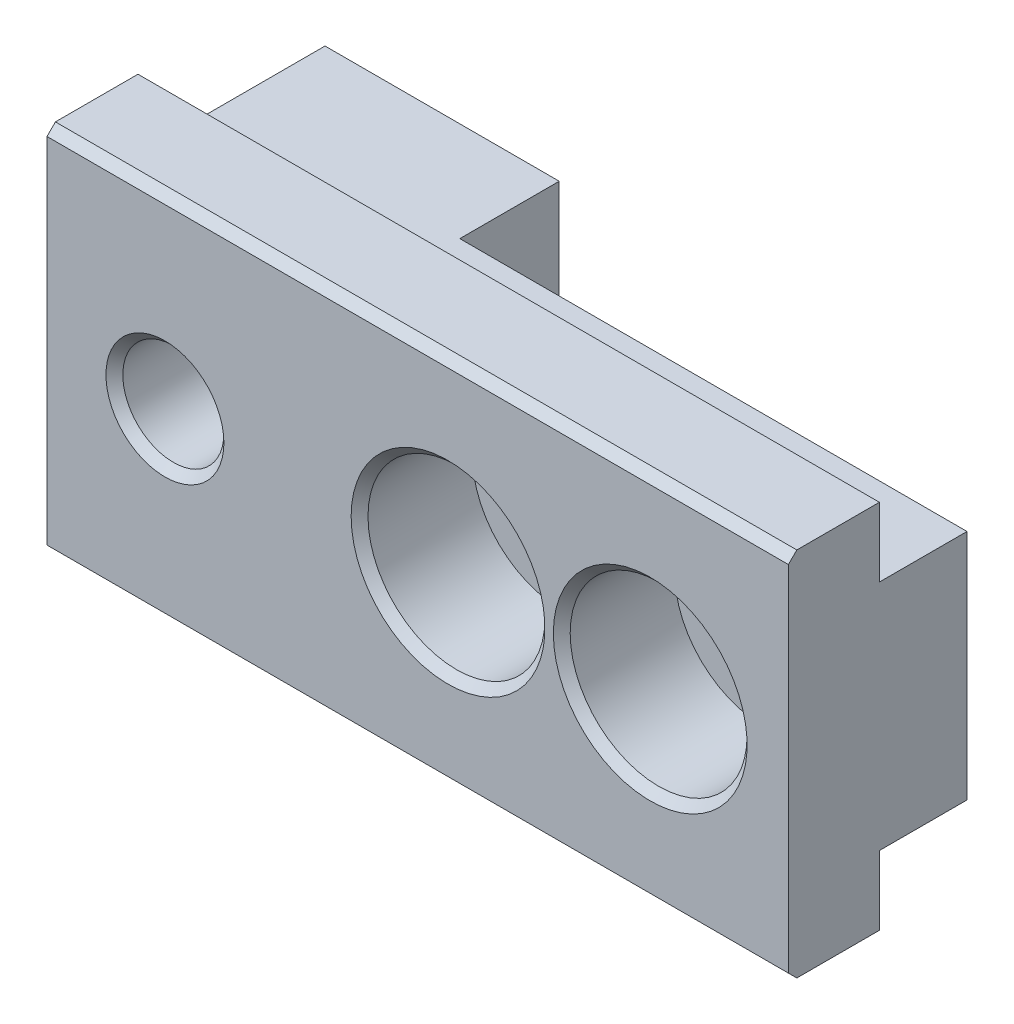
ISO-10303-21;
HEADER;
FILE_DESCRIPTION(('STEP AP214'),'2;1');
FILE_NAME('part.step','',(''),(''),'','','');
FILE_SCHEMA(('AUTOMOTIVE_DESIGN { 1 0 10303 214 1 1 1 1 }'));
ENDSEC;
DATA;
#1=APPLICATION_CONTEXT('core data for automotive mechanical design processes');
#2=APPLICATION_PROTOCOL_DEFINITION('international standard','automotive_design',2000,#1);
#3=PRODUCT_CONTEXT('',#1,'mechanical');
#4=PRODUCT('Part','Part','',(#3));
#5=PRODUCT_RELATED_PRODUCT_CATEGORY('part','',(#4));
#6=PRODUCT_DEFINITION_FORMATION('','',#4);
#7=PRODUCT_DEFINITION_CONTEXT('part definition',#1,'design');
#8=PRODUCT_DEFINITION('design','',#6,#7);
#9=PRODUCT_DEFINITION_SHAPE('','',#8);
#10=(LENGTH_UNIT() NAMED_UNIT(*) SI_UNIT(.MILLI.,.METRE.));
#11=(NAMED_UNIT(*) PLANE_ANGLE_UNIT() SI_UNIT($,.RADIAN.));
#12=(NAMED_UNIT(*) SI_UNIT($,.STERADIAN.) SOLID_ANGLE_UNIT());
#13=UNCERTAINTY_MEASURE_WITH_UNIT(LENGTH_MEASURE(1.E-05),#10,'distance_accuracy_value','');
#14=(GEOMETRIC_REPRESENTATION_CONTEXT(3) GLOBAL_UNCERTAINTY_ASSIGNED_CONTEXT((#13)) GLOBAL_UNIT_ASSIGNED_CONTEXT((#10,
#11,#12)) REPRESENTATION_CONTEXT('',''));
#15=CARTESIAN_POINT('',(0.,0.,0.));
#16=DIRECTION('',(0.,0.,1.));
#17=DIRECTION('',(1.,0.,0.));
#18=AXIS2_PLACEMENT_3D('',#15,#16,#17);
#19=CARTESIAN_POINT('',(28.8,0.,5.4000000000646));
#20=DIRECTION('',(0.,0.,-1.));
#21=DIRECTION('',(0.,1.,0.));
#22=AXIS2_PLACEMENT_3D('',#19,#20,#21);
#23=CYLINDRICAL_SURFACE('',#22,3.1);
#24=CARTESIAN_POINT('',(28.8,0.,-4.7));
#25=DIRECTION('',(0.,0.,1.));
#26=DIRECTION('',(0.,-1.,0.));
#27=AXIS2_PLACEMENT_3D('',#24,#25,#26);
#28=CIRCLE('',#27,3.1);
#29=CARTESIAN_POINT('',(28.8,-3.1,-4.70000000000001));
#30=VERTEX_POINT('',#29);
#31=EDGE_CURVE('E215',#30,#30,#28,.F.);
#32=ORIENTED_EDGE('',*,*,#31,.T.);
#33=EDGE_LOOP('',(#32));
#34=FACE_BOUND('',#33,.T.);
#35=CARTESIAN_POINT('',(28.8,0.,-1.3));
#36=DIRECTION('',(0.,0.,1.));
#37=DIRECTION('',(1.,0.,0.));
#38=AXIS2_PLACEMENT_3D('',#35,#36,#37);
#39=CIRCLE('',#38,3.1);
#40=CARTESIAN_POINT('',(31.9,0.,-1.3));
#41=VERTEX_POINT('',#40);
#42=EDGE_CURVE('E18',#41,#41,#39,.F.);
#43=ORIENTED_EDGE('',*,*,#42,.F.);
#44=EDGE_LOOP('',(#43));
#45=FACE_BOUND('',#44,.T.);
#46=ADVANCED_FACE('F14',(#34,#45),#23,.F.);
#47=CARTESIAN_POINT('',(16.8,0.,5.4000000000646));
#48=DIRECTION('',(0.,0.,-1.));
#49=DIRECTION('',(0.,1.,0.));
#50=AXIS2_PLACEMENT_3D('',#47,#48,#49);
#51=CYLINDRICAL_SURFACE('',#50,3.1);
#52=CARTESIAN_POINT('',(16.8,0.,-4.7));
#53=DIRECTION('',(0.,0.,1.));
#54=DIRECTION('',(0.,-1.,0.));
#55=AXIS2_PLACEMENT_3D('',#52,#53,#54);
#56=CIRCLE('',#55,3.1);
#57=CARTESIAN_POINT('',(16.8,-3.1,-4.70000000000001));
#58=VERTEX_POINT('',#57);
#59=EDGE_CURVE('E224',#58,#58,#56,.F.);
#60=ORIENTED_EDGE('',*,*,#59,.T.);
#61=EDGE_LOOP('',(#60));
#62=FACE_BOUND('',#61,.T.);
#63=CARTESIAN_POINT('',(16.8,0.,-1.3));
#64=DIRECTION('',(0.,0.,1.));
#65=DIRECTION('',(1.,0.,0.));
#66=AXIS2_PLACEMENT_3D('',#63,#64,#65);
#67=CIRCLE('',#66,3.1);
#68=CARTESIAN_POINT('',(19.9,0.,-1.3));
#69=VERTEX_POINT('',#68);
#70=EDGE_CURVE('E234',#69,#69,#67,.F.);
#71=ORIENTED_EDGE('',*,*,#70,.F.);
#72=EDGE_LOOP('',(#71));
#73=FACE_BOUND('',#72,.T.);
#74=ADVANCED_FACE('F271',(#62,#73),#51,.F.);
#75=CARTESIAN_POINT('',(0.,0.,-11.0999999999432));
#76=DIRECTION('',(0.,0.,-1.));
#77=DIRECTION('',(-1.,0.,0.));
#78=AXIS2_PLACEMENT_3D('',#75,#76,#77);
#79=CONICAL_SURFACE('',#78,3.50000000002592,0.785398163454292);
#80=CARTESIAN_POINT('',(0.,0.,-11.0999999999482));
#81=DIRECTION('',(0.,0.,-1.));
#82=DIRECTION('',(-1.,0.,0.));
#83=AXIS2_PLACEMENT_3D('',#80,#81,#82);
#84=CIRCLE('',#83,3.50000000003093);
#85=CARTESIAN_POINT('',(-3.50000000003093,0.,-11.0999999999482));
#86=VERTEX_POINT('',#85);
#87=EDGE_CURVE('E189',#86,#86,#84,.T.);
#88=ORIENTED_EDGE('',*,*,#87,.T.);
#89=EDGE_LOOP('',(#88));
#90=FACE_BOUND('',#89,.T.);
#91=CARTESIAN_POINT('',(0.,0.,-10.6));
#92=DIRECTION('',(0.,0.,1.));
#93=DIRECTION('',(1.,0.,0.));
#94=AXIS2_PLACEMENT_3D('',#91,#92,#93);
#95=CIRCLE('',#94,3.);
#96=CARTESIAN_POINT('',(3.,0.,-10.6));
#97=VERTEX_POINT('',#96);
#98=EDGE_CURVE('E145',#97,#97,#95,.T.);
#99=ORIENTED_EDGE('',*,*,#98,.T.);
#100=EDGE_LOOP('',(#99));
#101=FACE_BOUND('',#100,.T.);
#102=ADVANCED_FACE('F278',(#90,#101),#79,.F.);
#103=CARTESIAN_POINT('',(0.,0.,0.4));
#104=DIRECTION('',(0.,0.,1.));
#105=DIRECTION('',(1.,0.,0.));
#106=AXIS2_PLACEMENT_3D('',#103,#104,#105);
#107=CYLINDRICAL_SURFACE('',#106,3.);
#108=CARTESIAN_POINT('',(0.,0.,4.9000000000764));
#109=DIRECTION('',(0.,0.,1.));
#110=DIRECTION('',(1.,0.,0.));
#111=AXIS2_PLACEMENT_3D('',#108,#109,#110);
#112=CIRCLE('',#111,2.99999999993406);
#113=CARTESIAN_POINT('',(2.99999999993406,0.,4.9000000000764));
#114=VERTEX_POINT('',#113);
#115=EDGE_CURVE('E179',#114,#114,#112,.T.);
#116=ORIENTED_EDGE('',*,*,#115,.T.);
#117=EDGE_LOOP('',(#116));
#118=FACE_BOUND('',#117,.T.);
#119=ORIENTED_EDGE('',*,*,#98,.F.);
#120=EDGE_LOOP('',(#119));
#121=FACE_BOUND('',#120,.T.);
#122=ADVANCED_FACE('F330',(#118,#121),#107,.F.);
#123=CARTESIAN_POINT('',(7.,-6.9,-11.1));
#124=DIRECTION('',(0.,0.,1.));
#125=DIRECTION('',(1.,0.,0.));
#126=AXIS2_PLACEMENT_3D('',#123,#124,#125);
#127=PLANE('',#126);
#128=DIRECTION('',(1.,0.,0.));
#129=VECTOR('',#128,1.);
#130=CARTESIAN_POINT('',(7.,6.9,-11.1));
#131=LINE('',#130,#129);
#132=CARTESIAN_POINT('',(-7.,6.9,-11.1));
#133=VERTEX_POINT('',#132);
#134=CARTESIAN_POINT('',(6.9,6.9,-11.1));
#135=VERTEX_POINT('',#134);
#136=EDGE_CURVE('E117',#133,#135,#131,.T.);
#137=ORIENTED_EDGE('',*,*,#136,.T.);
#138=DIRECTION('',(0.,1.,0.));
#139=VECTOR('',#138,1.);
#140=CARTESIAN_POINT('',(6.9,-15.5837353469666,-11.1));
#141=LINE('',#140,#139);
#142=CARTESIAN_POINT('',(6.9,-6.9,-11.1));
#143=VERTEX_POINT('',#142);
#144=EDGE_CURVE('E31',#143,#135,#141,.T.);
#145=ORIENTED_EDGE('',*,*,#144,.F.);
#146=DIRECTION('',(-1.,0.,0.));
#147=VECTOR('',#146,1.);
#148=CARTESIAN_POINT('',(7.,-6.9,-11.1));
#149=LINE('',#148,#147);
#150=CARTESIAN_POINT('',(-7.,-6.9,-11.1));
#151=VERTEX_POINT('',#150);
#152=EDGE_CURVE('E118',#143,#151,#149,.T.);
#153=ORIENTED_EDGE('',*,*,#152,.T.);
#154=DIRECTION('',(0.,-1.,0.));
#155=VECTOR('',#154,1.);
#156=CARTESIAN_POINT('',(-7.,-6.9,-11.1));
#157=LINE('',#156,#155);
#158=EDGE_CURVE('E171',#133,#151,#157,.T.);
#159=ORIENTED_EDGE('',*,*,#158,.F.);
#160=EDGE_LOOP('',(#137,#145,#153,#159));
#161=FACE_BOUND('',#160,.T.);
#162=ORIENTED_EDGE('',*,*,#87,.F.);
#163=EDGE_LOOP('',(#162));
#164=FACE_BOUND('',#163,.T.);
#165=ADVANCED_FACE('F326',(#161,#164),#127,.F.);
#166=CARTESIAN_POINT('',(7.,-12.3,0.));
#167=DIRECTION('',(0.,0.,1.));
#168=DIRECTION('',(1.,0.,0.));
#169=AXIS2_PLACEMENT_3D('',#166,#167,#168);
#170=PLANE('',#169);
#171=DIRECTION('',(0.,1.,0.));
#172=VECTOR('',#171,1.);
#173=CARTESIAN_POINT('',(37.,-6.9,0.));
#174=LINE('',#173,#172);
#175=CARTESIAN_POINT('',(37.,-11.,0.));
#176=VERTEX_POINT('',#175);
#177=CARTESIAN_POINT('',(37.,-6.9,0.));
#178=VERTEX_POINT('',#177);
#179=EDGE_CURVE('E162',#176,#178,#174,.T.);
#180=ORIENTED_EDGE('',*,*,#179,.F.);
#181=DIRECTION('',(-1.,0.,0.));
#182=VECTOR('',#181,1.);
#183=CARTESIAN_POINT('',(7.,-11.,0.));
#184=LINE('',#183,#182);
#185=CARTESIAN_POINT('',(-7.,-11.,0.));
#186=VERTEX_POINT('',#185);
#187=EDGE_CURVE('E141',#176,#186,#184,.T.);
#188=ORIENTED_EDGE('',*,*,#187,.T.);
#189=DIRECTION('',(0.,-1.,0.));
#190=VECTOR('',#189,1.);
#191=CARTESIAN_POINT('',(-7.,-6.9,0.));
#192=LINE('',#191,#190);
#193=CARTESIAN_POINT('',(-7.,-6.9,0.));
#194=VERTEX_POINT('',#193);
#195=EDGE_CURVE('E165',#194,#186,#192,.T.);
#196=ORIENTED_EDGE('',*,*,#195,.F.);
#197=DIRECTION('',(-1.,0.,0.));
#198=VECTOR('',#197,1.);
#199=CARTESIAN_POINT('',(7.,-6.9,0.));
#200=LINE('',#199,#198);
#201=EDGE_CURVE('E187',#194,#178,#200,.F.);
#202=ORIENTED_EDGE('',*,*,#201,.T.);
#203=EDGE_LOOP('',(#180,#188,#196,#202));
#204=FACE_BOUND('',#203,.T.);
#205=ADVANCED_FACE('F323',(#204),#170,.F.);
#206=CARTESIAN_POINT('',(7.,-6.9,-11.1));
#207=DIRECTION('',(0.,1.,0.));
#208=DIRECTION('',(-1.,0.,0.));
#209=AXIS2_PLACEMENT_3D('',#206,#207,#208);
#210=PLANE('',#209);
#211=DIRECTION('',(0.,0.,1.));
#212=VECTOR('',#211,1.);
#213=CARTESIAN_POINT('',(6.9,-6.9,-11.1));
#214=LINE('',#213,#212);
#215=CARTESIAN_POINT('',(6.9,-6.9,-5.2));
#216=VERTEX_POINT('',#215);
#217=EDGE_CURVE('E121',#143,#216,#214,.T.);
#218=ORIENTED_EDGE('',*,*,#217,.T.);
#219=DIRECTION('',(1.,0.,0.));
#220=VECTOR('',#219,1.);
#221=CARTESIAN_POINT('',(37.,-6.9,-5.2));
#222=LINE('',#221,#220);
#223=CARTESIAN_POINT('',(37.,-6.9,-5.2));
#224=VERTEX_POINT('',#223);
#225=EDGE_CURVE('E107',#216,#224,#222,.T.);
#226=ORIENTED_EDGE('',*,*,#225,.T.);
#227=DIRECTION('',(0.,0.,1.));
#228=VECTOR('',#227,1.);
#229=CARTESIAN_POINT('',(37.,-6.9,-11.1));
#230=LINE('',#229,#228);
#231=EDGE_CURVE('E160',#178,#224,#230,.F.);
#232=ORIENTED_EDGE('',*,*,#231,.F.);
#233=ORIENTED_EDGE('',*,*,#201,.F.);
#234=DIRECTION('',(0.,0.,1.));
#235=VECTOR('',#234,1.);
#236=CARTESIAN_POINT('',(-7.,-6.9,-11.1));
#237=LINE('',#236,#235);
#238=EDGE_CURVE('E168',#151,#194,#237,.T.);
#239=ORIENTED_EDGE('',*,*,#238,.F.);
#240=ORIENTED_EDGE('',*,*,#152,.F.);
#241=EDGE_LOOP('',(#218,#226,#232,#233,#239,#240));
#242=FACE_BOUND('',#241,.T.);
#243=ADVANCED_FACE('F125',(#242),#210,.F.);
#244=CARTESIAN_POINT('',(37.,6.9,-5.2));
#245=DIRECTION('',(0.,0.,1.));
#246=DIRECTION('',(0.,-1.,0.));
#247=AXIS2_PLACEMENT_3D('',#244,#245,#246);
#248=PLANE('',#247);
#249=CARTESIAN_POINT('',(28.8,0.,-5.2));
#250=DIRECTION('',(0.,0.,1.));
#251=DIRECTION('',(0.,-1.,0.));
#252=AXIS2_PLACEMENT_3D('',#249,#250,#251);
#253=CIRCLE('',#252,3.6);
#254=CARTESIAN_POINT('',(28.8,-3.6,-5.2));
#255=VERTEX_POINT('',#254);
#256=EDGE_CURVE('E221',#255,#255,#253,.T.);
#257=ORIENTED_EDGE('',*,*,#256,.T.);
#258=EDGE_LOOP('',(#257));
#259=FACE_BOUND('',#258,.T.);
#260=CARTESIAN_POINT('',(16.8,0.,-5.2));
#261=DIRECTION('',(0.,0.,1.));
#262=DIRECTION('',(0.,-1.,0.));
#263=AXIS2_PLACEMENT_3D('',#260,#261,#262);
#264=CIRCLE('',#263,3.6);
#265=CARTESIAN_POINT('',(16.8,-3.6,-5.2));
#266=VERTEX_POINT('',#265);
#267=EDGE_CURVE('E218',#266,#266,#264,.T.);
#268=ORIENTED_EDGE('',*,*,#267,.T.);
#269=EDGE_LOOP('',(#268));
#270=FACE_BOUND('',#269,.T.);
#271=DIRECTION('',(0.,1.,0.));
#272=VECTOR('',#271,1.);
#273=CARTESIAN_POINT('',(37.,-6.9,-5.2));
#274=LINE('',#273,#272);
#275=CARTESIAN_POINT('',(37.,6.9,-5.2));
#276=VERTEX_POINT('',#275);
#277=EDGE_CURVE('E112',#224,#276,#274,.T.);
#278=ORIENTED_EDGE('',*,*,#277,.F.);
#279=ORIENTED_EDGE('',*,*,#225,.F.);
#280=DIRECTION('',(0.,1.,0.));
#281=VECTOR('',#280,1.);
#282=CARTESIAN_POINT('',(6.9,-15.5837353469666,-5.2));
#283=LINE('',#282,#281);
#284=CARTESIAN_POINT('',(6.9,6.9,-5.2));
#285=VERTEX_POINT('',#284);
#286=EDGE_CURVE('E110',#216,#285,#283,.T.);
#287=ORIENTED_EDGE('',*,*,#286,.T.);
#288=DIRECTION('',(1.,0.,0.));
#289=VECTOR('',#288,1.);
#290=CARTESIAN_POINT('',(7.,6.9,-5.2));
#291=LINE('',#290,#289);
#292=EDGE_CURVE('E182',#285,#276,#291,.T.);
#293=ORIENTED_EDGE('',*,*,#292,.T.);
#294=EDGE_LOOP('',(#278,#279,#287,#293));
#295=FACE_BOUND('',#294,.T.);
#296=ADVANCED_FACE('F109',(#259,#270,#295),#248,.F.);
#297=CARTESIAN_POINT('',(7.,6.9,-11.1));
#298=DIRECTION('',(0.,-1.,0.));
#299=DIRECTION('',(1.,0.,0.));
#300=AXIS2_PLACEMENT_3D('',#297,#298,#299);
#301=PLANE('',#300);
#302=DIRECTION('',(1.,0.,0.));
#303=VECTOR('',#302,1.);
#304=CARTESIAN_POINT('',(7.,6.9,0.));
#305=LINE('',#304,#303);
#306=CARTESIAN_POINT('',(-7.,6.9,0.));
#307=VERTEX_POINT('',#306);
#308=CARTESIAN_POINT('',(37.,6.9,0.));
#309=VERTEX_POINT('',#308);
#310=EDGE_CURVE('E180',#307,#309,#305,.T.);
#311=ORIENTED_EDGE('',*,*,#310,.T.);
#312=DIRECTION('',(0.,0.,1.));
#313=VECTOR('',#312,1.);
#314=CARTESIAN_POINT('',(37.,6.9,-11.1));
#315=LINE('',#314,#313);
#316=EDGE_CURVE('E156',#276,#309,#315,.T.);
#317=ORIENTED_EDGE('',*,*,#316,.F.);
#318=ORIENTED_EDGE('',*,*,#292,.F.);
#319=DIRECTION('',(0.,0.,-1.));
#320=VECTOR('',#319,1.);
#321=CARTESIAN_POINT('',(6.9,6.9,-11.1));
#322=LINE('',#321,#320);
#323=EDGE_CURVE('E122',#285,#135,#322,.T.);
#324=ORIENTED_EDGE('',*,*,#323,.T.);
#325=ORIENTED_EDGE('',*,*,#136,.F.);
#326=DIRECTION('',(0.,0.,1.));
#327=VECTOR('',#326,1.);
#328=CARTESIAN_POINT('',(-7.,6.9,-11.1));
#329=LINE('',#328,#327);
#330=EDGE_CURVE('E174',#307,#133,#329,.F.);
#331=ORIENTED_EDGE('',*,*,#330,.F.);
#332=EDGE_LOOP('',(#311,#317,#318,#324,#325,#331));
#333=FACE_BOUND('',#332,.T.);
#334=ADVANCED_FACE('F313',(#333),#301,.F.);
#335=CARTESIAN_POINT('',(7.,6.9,0.));
#336=DIRECTION('',(0.,0.,1.));
#337=DIRECTION('',(1.,0.,0.));
#338=AXIS2_PLACEMENT_3D('',#335,#336,#337);
#339=PLANE('',#338);
#340=DIRECTION('',(0.,-1.,0.));
#341=VECTOR('',#340,1.);
#342=CARTESIAN_POINT('',(-7.,-6.9,0.));
#343=LINE('',#342,#341);
#344=CARTESIAN_POINT('',(-7.,11.,0.));
#345=VERTEX_POINT('',#344);
#346=EDGE_CURVE('E177',#345,#307,#343,.T.);
#347=ORIENTED_EDGE('',*,*,#346,.F.);
#348=DIRECTION('',(1.,0.,0.));
#349=VECTOR('',#348,1.);
#350=CARTESIAN_POINT('',(7.,11.,0.));
#351=LINE('',#350,#349);
#352=CARTESIAN_POINT('',(37.,11.,0.));
#353=VERTEX_POINT('',#352);
#354=EDGE_CURVE('E133',#345,#353,#351,.T.);
#355=ORIENTED_EDGE('',*,*,#354,.T.);
#356=DIRECTION('',(0.,1.,0.));
#357=VECTOR('',#356,1.);
#358=CARTESIAN_POINT('',(37.,-6.9,0.));
#359=LINE('',#358,#357);
#360=EDGE_CURVE('E153',#309,#353,#359,.T.);
#361=ORIENTED_EDGE('',*,*,#360,.F.);
#362=ORIENTED_EDGE('',*,*,#310,.F.);
#363=EDGE_LOOP('',(#347,#355,#361,#362));
#364=FACE_BOUND('',#363,.T.);
#365=ADVANCED_FACE('F309',(#364),#339,.F.);
#366=CARTESIAN_POINT('',(0.,0.,5.40000000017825));
#367=DIRECTION('',(0.,0.,1.));
#368=DIRECTION('',(1.,0.,0.));
#369=AXIS2_PLACEMENT_3D('',#366,#367,#368);
#370=CONICAL_SURFACE('',#369,3.50000000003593,0.785398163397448);
#371=CARTESIAN_POINT('',(0.,0.,5.4000000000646));
#372=DIRECTION('',(0.,0.,1.));
#373=DIRECTION('',(1.,0.,0.));
#374=AXIS2_PLACEMENT_3D('',#371,#372,#373);
#375=CIRCLE('',#374,3.49999999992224);
#376=CARTESIAN_POINT('',(3.49999999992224,0.,5.4000000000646));
#377=VERTEX_POINT('',#376);
#378=EDGE_CURVE('E152',#377,#377,#375,.T.);
#379=ORIENTED_EDGE('',*,*,#378,.T.);
#380=EDGE_LOOP('',(#379));
#381=FACE_BOUND('',#380,.T.);
#382=ORIENTED_EDGE('',*,*,#115,.F.);
#383=EDGE_LOOP('',(#382));
#384=FACE_BOUND('',#383,.T.);
#385=ADVANCED_FACE('F305',(#381,#384),#370,.F.);
#386=CARTESIAN_POINT('',(-7.,-6.9,-11.1));
#387=DIRECTION('',(-1.,0.,0.));
#388=DIRECTION('',(0.,-1.,0.));
#389=AXIS2_PLACEMENT_3D('',#386,#387,#388);
#390=PLANE('',#389);
#391=DIRECTION('',(0.,1.,0.));
#392=VECTOR('',#391,1.);
#393=CARTESIAN_POINT('',(-7.,-12.3,5.4));
#394=LINE('',#393,#392);
#395=CARTESIAN_POINT('',(-7.,-10.5,5.4));
#396=VERTEX_POINT('',#395);
#397=CARTESIAN_POINT('',(-7.,10.5,5.4));
#398=VERTEX_POINT('',#397);
#399=EDGE_CURVE('E149',#396,#398,#394,.T.);
#400=ORIENTED_EDGE('',*,*,#399,.T.);
#401=DIRECTION('',(0.,-0.707106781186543,0.707106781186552));
#402=VECTOR('',#401,1.);
#403=CARTESIAN_POINT('',(-7.,10.0500000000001,5.84999999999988));
#404=LINE('',#403,#402);
#405=CARTESIAN_POINT('',(-7.,11.,4.9));
#406=VERTEX_POINT('',#405);
#407=EDGE_CURVE('E205',#398,#406,#404,.F.);
#408=ORIENTED_EDGE('',*,*,#407,.T.);
#409=DIRECTION('',(0.,0.,-1.));
#410=VECTOR('',#409,1.);
#411=CARTESIAN_POINT('',(-7.,11.,8.14875405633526));
#412=LINE('',#411,#410);
#413=EDGE_CURVE('E129',#406,#345,#412,.T.);
#414=ORIENTED_EDGE('',*,*,#413,.T.);
#415=ORIENTED_EDGE('',*,*,#346,.T.);
#416=ORIENTED_EDGE('',*,*,#330,.T.);
#417=ORIENTED_EDGE('',*,*,#158,.T.);
#418=ORIENTED_EDGE('',*,*,#238,.T.);
#419=ORIENTED_EDGE('',*,*,#195,.T.);
#420=DIRECTION('',(0.,0.,1.));
#421=VECTOR('',#420,1.);
#422=CARTESIAN_POINT('',(-7.,-11.,8.14875405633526));
#423=LINE('',#422,#421);
#424=CARTESIAN_POINT('',(-7.,-11.,4.9));
#425=VERTEX_POINT('',#424);
#426=EDGE_CURVE('E138',#186,#425,#423,.T.);
#427=ORIENTED_EDGE('',*,*,#426,.T.);
#428=DIRECTION('',(0.,-0.707106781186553,-0.707106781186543));
#429=VECTOR('',#428,1.);
#430=CARTESIAN_POINT('',(-7.,-16.95,-1.04999999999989));
#431=LINE('',#430,#429);
#432=EDGE_CURVE('E203',#425,#396,#431,.F.);
#433=ORIENTED_EDGE('',*,*,#432,.T.);
#434=EDGE_LOOP('',(#400,#408,#414,#415,#416,#417,#418,#419,#427,#433));
#435=FACE_BOUND('',#434,.T.);
#436=ADVANCED_FACE('F302',(#435),#390,.T.);
#437=CARTESIAN_POINT('',(37.,-6.9,-11.1));
#438=DIRECTION('',(1.,0.,0.));
#439=DIRECTION('',(0.,1.,0.));
#440=AXIS2_PLACEMENT_3D('',#437,#438,#439);
#441=PLANE('',#440);
#442=ORIENTED_EDGE('',*,*,#179,.T.);
#443=ORIENTED_EDGE('',*,*,#231,.T.);
#444=ORIENTED_EDGE('',*,*,#277,.T.);
#445=ORIENTED_EDGE('',*,*,#316,.T.);
#446=ORIENTED_EDGE('',*,*,#360,.T.);
#447=DIRECTION('',(0.,0.,-1.));
#448=VECTOR('',#447,1.);
#449=CARTESIAN_POINT('',(37.,11.,8.14875405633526));
#450=LINE('',#449,#448);
#451=CARTESIAN_POINT('',(37.,11.,4.9));
#452=VERTEX_POINT('',#451);
#453=EDGE_CURVE('E127',#452,#353,#450,.T.);
#454=ORIENTED_EDGE('',*,*,#453,.F.);
#455=DIRECTION('',(0.,0.707106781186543,-0.707106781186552));
#456=VECTOR('',#455,1.);
#457=CARTESIAN_POINT('',(37.,10.0500000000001,5.84999999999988));
#458=LINE('',#457,#456);
#459=CARTESIAN_POINT('',(37.,10.5,5.4));
#460=VERTEX_POINT('',#459);
#461=EDGE_CURVE('E210',#452,#460,#458,.F.);
#462=ORIENTED_EDGE('',*,*,#461,.T.);
#463=DIRECTION('',(0.,1.,0.));
#464=VECTOR('',#463,1.);
#465=CARTESIAN_POINT('',(37.,-12.3,5.4));
#466=LINE('',#465,#464);
#467=CARTESIAN_POINT('',(37.,-10.5,5.4));
#468=VERTEX_POINT('',#467);
#469=EDGE_CURVE('E146',#460,#468,#466,.F.);
#470=ORIENTED_EDGE('',*,*,#469,.T.);
#471=DIRECTION('',(0.,0.707106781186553,0.707106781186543));
#472=VECTOR('',#471,1.);
#473=CARTESIAN_POINT('',(37.,-16.95,-1.04999999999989));
#474=LINE('',#473,#472);
#475=CARTESIAN_POINT('',(37.,-11.,4.9));
#476=VERTEX_POINT('',#475);
#477=EDGE_CURVE('E39',#468,#476,#474,.F.);
#478=ORIENTED_EDGE('',*,*,#477,.T.);
#479=DIRECTION('',(0.,0.,1.));
#480=VECTOR('',#479,1.);
#481=CARTESIAN_POINT('',(37.,-11.,8.14875405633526));
#482=LINE('',#481,#480);
#483=EDGE_CURVE('E137',#176,#476,#482,.T.);
#484=ORIENTED_EDGE('',*,*,#483,.F.);
#485=EDGE_LOOP('',(#442,#443,#444,#445,#446,#454,#462,#470,#478,#484));
#486=FACE_BOUND('',#485,.T.);
#487=ADVANCED_FACE('F298',(#486),#441,.T.);
#488=CARTESIAN_POINT('',(7.,-12.3,5.4));
#489=DIRECTION('',(0.,0.,-1.));
#490=DIRECTION('',(-1.,0.,0.));
#491=AXIS2_PLACEMENT_3D('',#488,#489,#490);
#492=PLANE('',#491);
#493=CARTESIAN_POINT('',(28.8,0.,5.4));
#494=DIRECTION('',(0.,0.,-1.));
#495=DIRECTION('',(-1.,0.,0.));
#496=AXIS2_PLACEMENT_3D('',#493,#494,#495);
#497=CIRCLE('',#496,5.75);
#498=CARTESIAN_POINT('',(23.05,0.,5.4));
#499=VERTEX_POINT('',#498);
#500=EDGE_CURVE('E23',#499,#499,#497,.T.);
#501=ORIENTED_EDGE('',*,*,#500,.T.);
#502=EDGE_LOOP('',(#501));
#503=FACE_BOUND('',#502,.T.);
#504=CARTESIAN_POINT('',(16.8,0.,5.4));
#505=DIRECTION('',(0.,0.,-1.));
#506=DIRECTION('',(-1.,0.,0.));
#507=AXIS2_PLACEMENT_3D('',#504,#505,#506);
#508=CIRCLE('',#507,5.75);
#509=CARTESIAN_POINT('',(11.05,0.,5.4));
#510=VERTEX_POINT('',#509);
#511=EDGE_CURVE('E230',#510,#510,#508,.T.);
#512=ORIENTED_EDGE('',*,*,#511,.T.);
#513=EDGE_LOOP('',(#512));
#514=FACE_BOUND('',#513,.T.);
#515=DIRECTION('',(1.,0.,0.));
#516=VECTOR('',#515,1.);
#517=CARTESIAN_POINT('',(7.,-10.5,5.4));
#518=LINE('',#517,#516);
#519=EDGE_CURVE('E148',#396,#468,#518,.T.);
#520=ORIENTED_EDGE('',*,*,#519,.T.);
#521=ORIENTED_EDGE('',*,*,#469,.F.);
#522=DIRECTION('',(-1.,0.,0.));
#523=VECTOR('',#522,1.);
#524=CARTESIAN_POINT('',(7.,10.5,5.4));
#525=LINE('',#524,#523);
#526=EDGE_CURVE('E200',#460,#398,#525,.T.);
#527=ORIENTED_EDGE('',*,*,#526,.T.);
#528=ORIENTED_EDGE('',*,*,#399,.F.);
#529=EDGE_LOOP('',(#520,#521,#527,#528));
#530=FACE_BOUND('',#529,.T.);
#531=ORIENTED_EDGE('',*,*,#378,.F.);
#532=EDGE_LOOP('',(#531));
#533=FACE_BOUND('',#532,.T.);
#534=ADVANCED_FACE('F281',(#503,#514,#530,#533),#492,.F.);
#535=CARTESIAN_POINT('',(-7.,-11.,8.14875405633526));
#536=DIRECTION('',(0.,1.,0.));
#537=DIRECTION('',(0.,0.,1.));
#538=AXIS2_PLACEMENT_3D('',#535,#536,#537);
#539=PLANE('',#538);
#540=ORIENTED_EDGE('',*,*,#483,.T.);
#541=DIRECTION('',(-1.,0.,0.));
#542=VECTOR('',#541,1.);
#543=CARTESIAN_POINT('',(-7.,-11.,4.9));
#544=LINE('',#543,#542);
#545=EDGE_CURVE('E212',#476,#425,#544,.T.);
#546=ORIENTED_EDGE('',*,*,#545,.T.);
#547=ORIENTED_EDGE('',*,*,#426,.F.);
#548=ORIENTED_EDGE('',*,*,#187,.F.);
#549=EDGE_LOOP('',(#540,#546,#547,#548));
#550=FACE_BOUND('',#549,.T.);
#551=ADVANCED_FACE('F291',(#550),#539,.F.);
#552=CARTESIAN_POINT('',(-7.,11.,8.14875405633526));
#553=DIRECTION('',(0.,-1.,0.));
#554=DIRECTION('',(1.,0.,0.));
#555=AXIS2_PLACEMENT_3D('',#552,#553,#554);
#556=PLANE('',#555);
#557=ORIENTED_EDGE('',*,*,#413,.F.);
#558=DIRECTION('',(1.,0.,0.));
#559=VECTOR('',#558,1.);
#560=CARTESIAN_POINT('',(-7.,11.,4.9));
#561=LINE('',#560,#559);
#562=EDGE_CURVE('E207',#406,#452,#561,.T.);
#563=ORIENTED_EDGE('',*,*,#562,.T.);
#564=ORIENTED_EDGE('',*,*,#453,.T.);
#565=ORIENTED_EDGE('',*,*,#354,.F.);
#566=EDGE_LOOP('',(#557,#563,#564,#565));
#567=FACE_BOUND('',#566,.T.);
#568=ADVANCED_FACE('F287',(#567),#556,.F.);
#569=CARTESIAN_POINT('',(7.,10.5,5.4));
#570=DIRECTION('',(0.,-0.707106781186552,-0.707106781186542));
#571=DIRECTION('',(-1.,0.,0.));
#572=AXIS2_PLACEMENT_3D('',#569,#570,#571);
#573=PLANE('',#572);
#574=ORIENTED_EDGE('',*,*,#461,.F.);
#575=ORIENTED_EDGE('',*,*,#562,.F.);
#576=ORIENTED_EDGE('',*,*,#407,.F.);
#577=ORIENTED_EDGE('',*,*,#526,.F.);
#578=EDGE_LOOP('',(#574,#575,#576,#577));
#579=FACE_BOUND('',#578,.T.);
#580=ADVANCED_FACE('F290',(#579),#573,.F.);
#581=CARTESIAN_POINT('',(7.,-10.5,5.4));
#582=DIRECTION('',(0.,0.707106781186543,-0.707106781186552));
#583=DIRECTION('',(1.,0.,0.));
#584=AXIS2_PLACEMENT_3D('',#581,#582,#583);
#585=PLANE('',#584);
#586=ORIENTED_EDGE('',*,*,#432,.F.);
#587=ORIENTED_EDGE('',*,*,#545,.F.);
#588=ORIENTED_EDGE('',*,*,#477,.F.);
#589=ORIENTED_EDGE('',*,*,#519,.F.);
#590=EDGE_LOOP('',(#586,#587,#588,#589));
#591=FACE_BOUND('',#590,.T.);
#592=ADVANCED_FACE('F286',(#591),#585,.F.);
#593=CARTESIAN_POINT('',(6.9,-15.5837353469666,25.7532769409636));
#594=DIRECTION('',(-1.,0.,0.));
#595=DIRECTION('',(0.,-1.,0.));
#596=AXIS2_PLACEMENT_3D('',#593,#594,#595);
#597=PLANE('',#596);
#598=ORIENTED_EDGE('',*,*,#144,.T.);
#599=ORIENTED_EDGE('',*,*,#323,.F.);
#600=ORIENTED_EDGE('',*,*,#286,.F.);
#601=ORIENTED_EDGE('',*,*,#217,.F.);
#602=EDGE_LOOP('',(#598,#599,#600,#601));
#603=FACE_BOUND('',#602,.T.);
#604=ADVANCED_FACE('F120',(#603),#597,.F.);
#605=CARTESIAN_POINT('',(16.8,0.,0.4));
#606=DIRECTION('',(0.,0.,1.));
#607=DIRECTION('',(1.,0.,0.));
#608=AXIS2_PLACEMENT_3D('',#605,#606,#607);
#609=CYLINDRICAL_SURFACE('',#608,5.25);
#610=CARTESIAN_POINT('',(16.8,0.,4.9));
#611=DIRECTION('',(0.,0.,-1.));
#612=DIRECTION('',(-1.,0.,0.));
#613=AXIS2_PLACEMENT_3D('',#610,#611,#612);
#614=CIRCLE('',#613,5.25);
#615=CARTESIAN_POINT('',(11.55,0.,4.9));
#616=VERTEX_POINT('',#615);
#617=EDGE_CURVE('E9',#616,#616,#614,.F.);
#618=ORIENTED_EDGE('',*,*,#617,.T.);
#619=EDGE_LOOP('',(#618));
#620=FACE_BOUND('',#619,.T.);
#621=CARTESIAN_POINT('',(16.8,0.,-1.3));
#622=DIRECTION('',(0.,0.,1.));
#623=DIRECTION('',(1.,0.,0.));
#624=AXIS2_PLACEMENT_3D('',#621,#622,#623);
#625=CIRCLE('',#624,5.25);
#626=CARTESIAN_POINT('',(22.05,0.,-1.3));
#627=VERTEX_POINT('',#626);
#628=EDGE_CURVE('E236',#627,#627,#625,.T.);
#629=ORIENTED_EDGE('',*,*,#628,.F.);
#630=EDGE_LOOP('',(#629));
#631=FACE_BOUND('',#630,.T.);
#632=ADVANCED_FACE('F255',(#620,#631),#609,.F.);
#633=CARTESIAN_POINT('',(28.8,0.,0.4));
#634=DIRECTION('',(0.,0.,1.));
#635=DIRECTION('',(1.,0.,0.));
#636=AXIS2_PLACEMENT_3D('',#633,#634,#635);
#637=CYLINDRICAL_SURFACE('',#636,5.25);
#638=CARTESIAN_POINT('',(28.8,0.,4.9));
#639=DIRECTION('',(0.,0.,-1.));
#640=DIRECTION('',(-1.,0.,0.));
#641=AXIS2_PLACEMENT_3D('',#638,#639,#640);
#642=CIRCLE('',#641,5.25);
#643=CARTESIAN_POINT('',(23.55,0.,4.9));
#644=VERTEX_POINT('',#643);
#645=EDGE_CURVE('E227',#644,#644,#642,.F.);
#646=ORIENTED_EDGE('',*,*,#645,.T.);
#647=EDGE_LOOP('',(#646));
#648=FACE_BOUND('',#647,.T.);
#649=CARTESIAN_POINT('',(28.8,0.,-1.3));
#650=DIRECTION('',(0.,0.,1.));
#651=DIRECTION('',(1.,0.,0.));
#652=AXIS2_PLACEMENT_3D('',#649,#650,#651);
#653=CIRCLE('',#652,5.25);
#654=CARTESIAN_POINT('',(34.05,0.,-1.3));
#655=VERTEX_POINT('',#654);
#656=EDGE_CURVE('E244',#655,#655,#653,.T.);
#657=ORIENTED_EDGE('',*,*,#656,.F.);
#658=EDGE_LOOP('',(#657));
#659=FACE_BOUND('',#658,.T.);
#660=ADVANCED_FACE('F252',(#648,#659),#637,.F.);
#661=CARTESIAN_POINT('',(28.8,0.,-4.7));
#662=DIRECTION('',(0.,0.,-1.));
#663=DIRECTION('',(0.,1.,0.));
#664=AXIS2_PLACEMENT_3D('',#661,#662,#663);
#665=CONICAL_SURFACE('',#664,3.1,0.785398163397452);
#666=ORIENTED_EDGE('',*,*,#256,.F.);
#667=EDGE_LOOP('',(#666));
#668=FACE_BOUND('',#667,.T.);
#669=ORIENTED_EDGE('',*,*,#31,.F.);
#670=EDGE_LOOP('',(#669));
#671=FACE_BOUND('',#670,.T.);
#672=ADVANCED_FACE('F254',(#668,#671),#665,.F.);
#673=CARTESIAN_POINT('',(16.8,0.,-4.7));
#674=DIRECTION('',(0.,0.,-1.));
#675=DIRECTION('',(0.,1.,0.));
#676=AXIS2_PLACEMENT_3D('',#673,#674,#675);
#677=CONICAL_SURFACE('',#676,3.1,0.785398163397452);
#678=ORIENTED_EDGE('',*,*,#267,.F.);
#679=EDGE_LOOP('',(#678));
#680=FACE_BOUND('',#679,.T.);
#681=ORIENTED_EDGE('',*,*,#59,.F.);
#682=EDGE_LOOP('',(#681));
#683=FACE_BOUND('',#682,.T.);
#684=ADVANCED_FACE('F264',(#680,#683),#677,.F.);
#685=CARTESIAN_POINT('',(28.8,0.,4.9));
#686=DIRECTION('',(0.,0.,1.));
#687=DIRECTION('',(1.,0.,0.));
#688=AXIS2_PLACEMENT_3D('',#685,#686,#687);
#689=CONICAL_SURFACE('',#688,5.25,0.785398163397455);
#690=ORIENTED_EDGE('',*,*,#500,.F.);
#691=EDGE_LOOP('',(#690));
#692=FACE_BOUND('',#691,.T.);
#693=ORIENTED_EDGE('',*,*,#645,.F.);
#694=EDGE_LOOP('',(#693));
#695=FACE_BOUND('',#694,.T.);
#696=ADVANCED_FACE('F345',(#692,#695),#689,.F.);
#697=CARTESIAN_POINT('',(16.8,0.,4.9));
#698=DIRECTION('',(0.,0.,1.));
#699=DIRECTION('',(1.,0.,0.));
#700=AXIS2_PLACEMENT_3D('',#697,#698,#699);
#701=CONICAL_SURFACE('',#700,5.25,0.785398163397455);
#702=ORIENTED_EDGE('',*,*,#511,.F.);
#703=EDGE_LOOP('',(#702));
#704=FACE_BOUND('',#703,.T.);
#705=ORIENTED_EDGE('',*,*,#617,.F.);
#706=EDGE_LOOP('',(#705));
#707=FACE_BOUND('',#706,.T.);
#708=ADVANCED_FACE('F16',(#704,#707),#701,.F.);
#709=CARTESIAN_POINT('',(16.8,0.,-1.3));
#710=DIRECTION('',(0.,0.,1.));
#711=DIRECTION('',(1.,0.,0.));
#712=AXIS2_PLACEMENT_3D('',#709,#710,#711);
#713=PLANE('',#712);
#714=ORIENTED_EDGE('',*,*,#628,.T.);
#715=EDGE_LOOP('',(#714));
#716=FACE_BOUND('',#715,.T.);
#717=ORIENTED_EDGE('',*,*,#70,.T.);
#718=EDGE_LOOP('',(#717));
#719=FACE_BOUND('',#718,.T.);
#720=ADVANCED_FACE('F353',(#716,#719),#713,.T.);
#721=CARTESIAN_POINT('',(28.8,0.,-1.3));
#722=DIRECTION('',(0.,0.,1.));
#723=DIRECTION('',(1.,0.,0.));
#724=AXIS2_PLACEMENT_3D('',#721,#722,#723);
#725=PLANE('',#724);
#726=ORIENTED_EDGE('',*,*,#656,.T.);
#727=EDGE_LOOP('',(#726));
#728=FACE_BOUND('',#727,.T.);
#729=ORIENTED_EDGE('',*,*,#42,.T.);
#730=EDGE_LOOP('',(#729));
#731=FACE_BOUND('',#730,.T.);
#732=ADVANCED_FACE('F249',(#728,#731),#725,.T.);
#733=CLOSED_SHELL('',(#46,#74,#102,#122,#165,#205,#243,#296,#334,#365,#385,#436,#487,#534,#551,
#568,#580,#592,#604,#632,#660,#672,#684,#696,#708,#720,#732));
#734=MANIFOLD_SOLID_BREP('B1',#733);
#735=ADVANCED_BREP_SHAPE_REPRESENTATION('',(#18,#734),#14);
#736=SHAPE_DEFINITION_REPRESENTATION(#9,#735);
ENDSEC;
END-ISO-10303-21;
